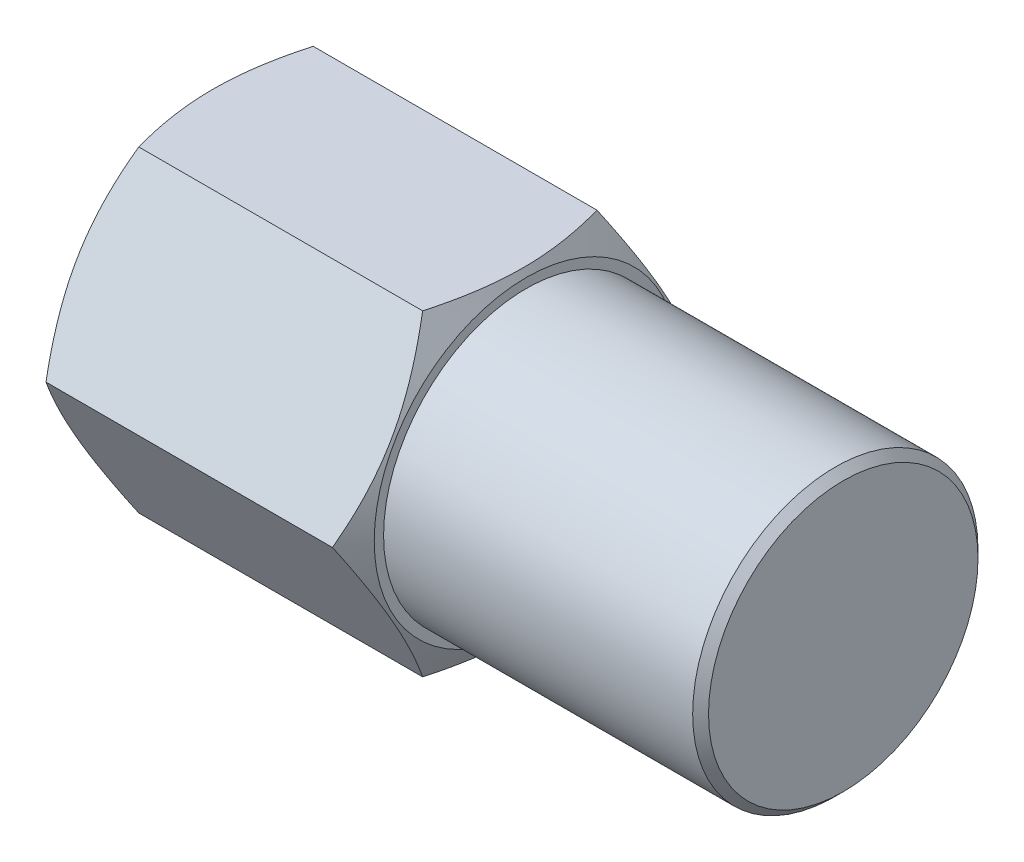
ISO-10303-21;
HEADER;
FILE_DESCRIPTION(('STEP AP214'),'2;1');
FILE_NAME('part.step','',(''),(''),'','','');
FILE_SCHEMA(('AUTOMOTIVE_DESIGN { 1 0 10303 214 1 1 1 1 }'));
ENDSEC;
DATA;
#1=APPLICATION_CONTEXT('core data for automotive mechanical design processes');
#2=APPLICATION_PROTOCOL_DEFINITION('international standard','automotive_design',2000,#1);
#3=PRODUCT_CONTEXT('',#1,'mechanical');
#4=PRODUCT('Part','Part','',(#3));
#5=PRODUCT_RELATED_PRODUCT_CATEGORY('part','',(#4));
#6=PRODUCT_DEFINITION_FORMATION('','',#4);
#7=PRODUCT_DEFINITION_CONTEXT('part definition',#1,'design');
#8=PRODUCT_DEFINITION('design','',#6,#7);
#9=PRODUCT_DEFINITION_SHAPE('','',#8);
#10=(LENGTH_UNIT() NAMED_UNIT(*) SI_UNIT(.MILLI.,.METRE.));
#11=(NAMED_UNIT(*) PLANE_ANGLE_UNIT() SI_UNIT($,.RADIAN.));
#12=(NAMED_UNIT(*) SI_UNIT($,.STERADIAN.) SOLID_ANGLE_UNIT());
#13=UNCERTAINTY_MEASURE_WITH_UNIT(LENGTH_MEASURE(1.E-05),#10,'distance_accuracy_value','');
#14=(GEOMETRIC_REPRESENTATION_CONTEXT(3) GLOBAL_UNCERTAINTY_ASSIGNED_CONTEXT((#13)) GLOBAL_UNIT_ASSIGNED_CONTEXT((#10,
#11,#12)) REPRESENTATION_CONTEXT('',''));
#15=CARTESIAN_POINT('',(0.,0.,0.));
#16=DIRECTION('',(0.,0.,1.));
#17=DIRECTION('',(1.,0.,0.));
#18=AXIS2_PLACEMENT_3D('',#15,#16,#17);
#19=CARTESIAN_POINT('',(-10.,0.,0.));
#20=DIRECTION('',(-1.,0.,0.));
#21=DIRECTION('',(0.,0.,1.));
#22=AXIS2_PLACEMENT_3D('',#19,#20,#21);
#23=CYLINDRICAL_SURFACE('',#22,3.);
#24=CARTESIAN_POINT('',(-4.,0.,0.));
#25=DIRECTION('',(-1.,0.,0.));
#26=DIRECTION('',(0.,0.,1.));
#27=AXIS2_PLACEMENT_3D('',#24,#25,#26);
#28=CIRCLE('',#27,3.);
#29=CARTESIAN_POINT('',(-4.,0.,3.));
#30=VERTEX_POINT('',#29);
#31=EDGE_CURVE('P0_E20',#30,#30,#28,.T.);
#32=ORIENTED_EDGE('',*,*,#31,.T.);
#33=EDGE_LOOP('',(#32));
#34=FACE_BOUND('',#33,.T.);
#35=CARTESIAN_POINT('',(-10.,0.,0.));
#36=DIRECTION('',(-1.,0.,0.));
#37=DIRECTION('',(0.,0.,1.));
#38=AXIS2_PLACEMENT_3D('',#35,#36,#37);
#39=CIRCLE('',#38,3.);
#40=CARTESIAN_POINT('',(-10.,0.,3.));
#41=VERTEX_POINT('',#40);
#42=EDGE_CURVE('P0_E11',#41,#41,#39,.F.);
#43=ORIENTED_EDGE('',*,*,#42,.T.);
#44=EDGE_LOOP('',(#43));
#45=FACE_BOUND('',#44,.T.);
#46=ADVANCED_FACE('P0_F16',(#34,#45),#23,.T.);
#47=CARTESIAN_POINT('',(-4.,0.,0.));
#48=DIRECTION('',(-1.,0.,0.));
#49=DIRECTION('',(0.,0.,1.));
#50=AXIS2_PLACEMENT_3D('',#47,#48,#49);
#51=PLANE('',#50);
#52=CARTESIAN_POINT('',(-4.,2.4,0.));
#53=CARTESIAN_POINT('',(-4.,2.39979755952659,0.458028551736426));
#54=CARTESIAN_POINT('',(-4.,2.23149192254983,0.883427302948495));
#55=CARTESIAN_POINT('',(-4.,2.04882177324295,1.3451328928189));
#56=CARTESIAN_POINT('',(-4.,1.69705627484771,1.69705627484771));
#57=CARTESIAN_POINT('',(-4.,1.34603579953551,2.04823429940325));
#58=CARTESIAN_POINT('',(-4.,0.883427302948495,2.23149192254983));
#59=CARTESIAN_POINT('',(-4.,0.458307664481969,2.39989871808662));
#60=CARTESIAN_POINT('',(-4.,0.,2.4));
#61=CARTESIAN_POINT('',(-4.,-0.457261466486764,2.40010105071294));
#62=CARTESIAN_POINT('',(-4.,-0.883427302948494,2.23149192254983));
#63=CARTESIAN_POINT('',(-4.,-1.34513289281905,2.0488217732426));
#64=CARTESIAN_POINT('',(-4.,-1.69705627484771,1.69705627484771));
#65=CARTESIAN_POINT('',(-4.,-2.04823429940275,1.3460357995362));
#66=CARTESIAN_POINT('',(-4.,-2.23149192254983,0.883427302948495));
#67=CARTESIAN_POINT('',(-4.,-2.39979732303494,0.458563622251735));
#68=CARTESIAN_POINT('',(-4.,-2.4,0.));
#69=B_SPLINE_CURVE_WITH_KNOTS('',2,(#52,#53,#54,#55,#56,#57,#58,#59,#60,#61,#62,#63,#64,#65,#66,
#67,#68),.UNSPECIFIED.,.F.,.F.,(3,2,2,2,2,2,2,2,3),(0.,0.125,0.25,0.375,0.5,0.625,0.75,0.875,
1.),.UNSPECIFIED.);
#70=CARTESIAN_POINT('',(-4.,2.4,0.));
#71=VERTEX_POINT('',#70);
#72=CARTESIAN_POINT('',(-4.,-2.4,0.));
#73=VERTEX_POINT('',#72);
#74=EDGE_CURVE('P0_E28',#71,#73,#69,.T.);
#75=ORIENTED_EDGE('',*,*,#74,.F.);
#76=CARTESIAN_POINT('',(-4.,-2.4,0.));
#77=CARTESIAN_POINT('',(-4.,-2.39979755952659,-0.458028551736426));
#78=CARTESIAN_POINT('',(-4.,-2.23149192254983,-0.883427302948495));
#79=CARTESIAN_POINT('',(-4.,-2.04882177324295,-1.3451328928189));
#80=CARTESIAN_POINT('',(-4.,-1.69705627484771,-1.69705627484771));
#81=CARTESIAN_POINT('',(-4.,-1.34603579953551,-2.04823429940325));
#82=CARTESIAN_POINT('',(-4.,-0.883427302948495,-2.23149192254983));
#83=CARTESIAN_POINT('',(-4.,-0.458307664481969,-2.39989871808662));
#84=CARTESIAN_POINT('',(-4.,0.,-2.4));
#85=CARTESIAN_POINT('',(-4.,0.457261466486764,-2.40010105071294));
#86=CARTESIAN_POINT('',(-4.,0.883427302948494,-2.23149192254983));
#87=CARTESIAN_POINT('',(-4.,1.34513289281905,-2.0488217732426));
#88=CARTESIAN_POINT('',(-4.,1.69705627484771,-1.69705627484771));
#89=CARTESIAN_POINT('',(-4.,2.04823429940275,-1.3460357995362));
#90=CARTESIAN_POINT('',(-4.,2.23149192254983,-0.883427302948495));
#91=CARTESIAN_POINT('',(-4.,2.39979732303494,-0.458563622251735));
#92=CARTESIAN_POINT('',(-4.,2.4,0.));
#93=B_SPLINE_CURVE_WITH_KNOTS('',2,(#76,#77,#78,#79,#80,#81,#82,#83,#84,#85,#86,#87,#88,#89,#90,
#91,#92),.UNSPECIFIED.,.F.,.F.,(3,2,2,2,2,2,2,2,3),(0.,0.125,0.25,0.375,0.5,0.625,0.75,0.875,
1.),.UNSPECIFIED.);
#94=EDGE_CURVE('P0_E33',#73,#71,#93,.T.);
#95=ORIENTED_EDGE('',*,*,#94,.F.);
#96=EDGE_LOOP('',(#75,#95));
#97=FACE_BOUND('',#96,.T.);
#98=ORIENTED_EDGE('',*,*,#31,.F.);
#99=EDGE_LOOP('',(#98));
#100=FACE_BOUND('',#99,.T.);
#101=ADVANCED_FACE('P0_F17',(#97,#100),#51,.F.);
#102=OPEN_SHELL('',(#46,#101));
#103=SHELL_BASED_SURFACE_MODEL('P0_B1',(#102));
#104=CARTESIAN_POINT('',(9.,0.,0.005403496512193));
#105=DIRECTION('',(-1.,0.,0.));
#106=DIRECTION('',(0.,0.,1.));
#107=AXIS2_PLACEMENT_3D('',#104,#105,#106);
#108=PLANE('',#107);
#109=CARTESIAN_POINT('',(9.,0.,0.005403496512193));
#110=DIRECTION('',(-1.,0.,0.));
#111=DIRECTION('',(0.,0.,1.));
#112=AXIS2_PLACEMENT_3D('',#109,#110,#111);
#113=CIRCLE('',#112,3.005403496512);
#114=CARTESIAN_POINT('',(9.,0.,3.01080699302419));
#115=VERTEX_POINT('',#114);
#116=EDGE_CURVE('P1_E19',#115,#115,#113,.T.);
#117=ORIENTED_EDGE('',*,*,#116,.T.);
#118=EDGE_LOOP('',(#117));
#119=FACE_BOUND('',#118,.T.);
#120=ADVANCED_FACE('P1_F16',(#119),#108,.T.);
#121=CARTESIAN_POINT('',(10.5,0.,0.005403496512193));
#122=DIRECTION('',(-1.,0.,0.));
#123=DIRECTION('',(0.,0.,1.));
#124=AXIS2_PLACEMENT_3D('',#121,#122,#123);
#125=CYLINDRICAL_SURFACE('',#124,3.005403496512);
#126=ORIENTED_EDGE('',*,*,#116,.F.);
#127=EDGE_LOOP('',(#126));
#128=FACE_BOUND('',#127,.T.);
#129=CARTESIAN_POINT('',(0.,0.,0.005403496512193));
#130=DIRECTION('',(-1.,0.,0.));
#131=DIRECTION('',(0.,0.,1.));
#132=AXIS2_PLACEMENT_3D('',#129,#130,#131);
#133=CIRCLE('',#132,3.005403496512);
#134=CARTESIAN_POINT('',(0.,0.,3.01080699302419));
#135=VERTEX_POINT('',#134);
#136=EDGE_CURVE('P1_E408',#135,#135,#133,.T.);
#137=ORIENTED_EDGE('',*,*,#136,.T.);
#138=EDGE_LOOP('',(#137));
#139=FACE_BOUND('',#138,.T.);
#140=ADVANCED_FACE('P1_F327',(#128,#139),#125,.F.);
#141=CARTESIAN_POINT('',(0.,27.5,-24.98464223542));
#142=DIRECTION('',(-1.,0.,0.));
#143=DIRECTION('',(0.,0.,1.));
#144=AXIS2_PLACEMENT_3D('',#141,#142,#143);
#145=PLANE('',#144);
#146=CARTESIAN_POINT('',(-5.6843418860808E-11,0.,0.));
#147=DIRECTION('',(1.,0.,0.));
#148=DIRECTION('',(0.,0.,-1.));
#149=AXIS2_PLACEMENT_3D('',#146,#147,#148);
#150=CIRCLE('',#149,2.65000000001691);
#151=CARTESIAN_POINT('',(-5.6843418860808E-11,0.,-2.65000000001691));
#152=VERTEX_POINT('',#151);
#153=EDGE_CURVE('P1_E251',#152,#152,#150,.F.);
#154=ORIENTED_EDGE('',*,*,#153,.T.);
#155=EDGE_LOOP('',(#154));
#156=FACE_BOUND('',#155,.T.);
#157=ORIENTED_EDGE('',*,*,#136,.F.);
#158=EDGE_LOOP('',(#157));
#159=FACE_BOUND('',#158,.T.);
#160=ADVANCED_FACE('P1_F318',(#156,#159),#145,.F.);
#161=CARTESIAN_POINT('',(-5.6843418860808E-11,0.,0.));
#162=DIRECTION('',(1.,0.,0.));
#163=DIRECTION('',(0.,0.,-1.));
#164=AXIS2_PLACEMENT_3D('',#161,#162,#163);
#165=CONICAL_SURFACE('',#164,2.65000000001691,0.785398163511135);
#166=CARTESIAN_POINT('',(-0.2500000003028,0.,0.));
#167=DIRECTION('',(1.,0.,0.));
#168=DIRECTION('',(0.,0.,-1.));
#169=AXIS2_PLACEMENT_3D('',#166,#167,#168);
#170=CIRCLE('',#169,2.4);
#171=CARTESIAN_POINT('',(-0.2500000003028,0.,-2.4));
#172=VERTEX_POINT('',#171);
#173=EDGE_CURVE('P1_E247',#172,#172,#170,.F.);
#174=ORIENTED_EDGE('',*,*,#173,.T.);
#175=EDGE_LOOP('',(#174));
#176=FACE_BOUND('',#175,.T.);
#177=ORIENTED_EDGE('',*,*,#153,.F.);
#178=EDGE_LOOP('',(#177));
#179=FACE_BOUND('',#178,.T.);
#180=ADVANCED_FACE('P1_F309',(#176,#179),#165,.F.);
#181=CARTESIAN_POINT('',(0.,0.,0.));
#182=DIRECTION('',(1.,0.,0.));
#183=DIRECTION('',(0.,0.,-1.));
#184=AXIS2_PLACEMENT_3D('',#181,#182,#183);
#185=CYLINDRICAL_SURFACE('',#184,2.4);
#186=ORIENTED_EDGE('',*,*,#173,.F.);
#187=EDGE_LOOP('',(#186));
#188=FACE_BOUND('',#187,.T.);
#189=CARTESIAN_POINT('',(-9.75000000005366,0.,0.));
#190=DIRECTION('',(-1.,0.,0.));
#191=DIRECTION('',(0.,0.,-1.));
#192=AXIS2_PLACEMENT_3D('',#189,#190,#191);
#193=CIRCLE('',#192,2.40000000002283);
#194=CARTESIAN_POINT('',(-9.75000000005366,0.,-2.40000000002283));
#195=VERTEX_POINT('',#194);
#196=EDGE_CURVE('P1_E250',#195,#195,#193,.T.);
#197=ORIENTED_EDGE('',*,*,#196,.T.);
#198=EDGE_LOOP('',(#197));
#199=FACE_BOUND('',#198,.T.);
#200=ADVANCED_FACE('P1_F301',(#188,#199),#185,.F.);
#201=CARTESIAN_POINT('',(-10.0000000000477,0.,0.));
#202=DIRECTION('',(-1.,0.,0.));
#203=DIRECTION('',(0.,0.,1.));
#204=AXIS2_PLACEMENT_3D('',#201,#202,#203);
#205=CONICAL_SURFACE('',#204,2.65000000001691,0.785398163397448);
#206=ORIENTED_EDGE('',*,*,#196,.F.);
#207=EDGE_LOOP('',(#206));
#208=FACE_BOUND('',#207,.T.);
#209=CARTESIAN_POINT('',(-10.0000000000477,0.,0.));
#210=DIRECTION('',(-1.,0.,0.));
#211=DIRECTION('',(0.,0.,1.));
#212=AXIS2_PLACEMENT_3D('',#209,#210,#211);
#213=CIRCLE('',#212,2.65000000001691);
#214=CARTESIAN_POINT('',(-10.0000000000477,0.,2.65000000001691));
#215=VERTEX_POINT('',#214);
#216=EDGE_CURVE('P1_E254',#215,#215,#213,.F.);
#217=ORIENTED_EDGE('',*,*,#216,.F.);
#218=EDGE_LOOP('',(#217));
#219=FACE_BOUND('',#218,.T.);
#220=ADVANCED_FACE('P1_F293',(#208,#219),#205,.F.);
#221=CARTESIAN_POINT('',(-10.,0.,0.));
#222=DIRECTION('',(-1.,0.,0.));
#223=DIRECTION('',(0.,0.,1.));
#224=AXIS2_PLACEMENT_3D('',#221,#222,#223);
#225=PLANE('',#224);
#226=ORIENTED_EDGE('',*,*,#216,.T.);
#227=EDGE_LOOP('',(#226));
#228=FACE_BOUND('',#227,.T.);
#229=CARTESIAN_POINT('',(-9.99999999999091,0.,0.));
#230=DIRECTION('',(1.,0.,0.));
#231=DIRECTION('',(0.,0.,-1.));
#232=AXIS2_PLACEMENT_3D('',#229,#230,#231);
#233=CIRCLE('',#232,4.79999999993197);
#234=CARTESIAN_POINT('',(-9.99999999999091,0.,-4.79999999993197));
#235=VERTEX_POINT('',#234);
#236=EDGE_CURVE('P1_E79',#235,#235,#233,.T.);
#237=ORIENTED_EDGE('',*,*,#236,.F.);
#238=EDGE_LOOP('',(#237));
#239=FACE_BOUND('',#238,.T.);
#240=ADVANCED_FACE('P1_F118',(#228,#239),#225,.T.);
#241=CARTESIAN_POINT('',(-9.47357534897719,0.,0.));
#242=DIRECTION('',(1.,0.,0.));
#243=DIRECTION('',(0.,0.,-1.));
#244=AXIS2_PLACEMENT_3D('',#241,#242,#243);
#245=CONICAL_SURFACE('',#244,5.7117942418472,1.04719755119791);
#246=CARTESIAN_POINT('',(-9.47671505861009,5.00000000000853,-2.74999999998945));
#247=CARTESIAN_POINT('',(-9.53960063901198,5.00000000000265,-2.5240517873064));
#248=CARTESIAN_POINT('',(-9.59698477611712,5.00000000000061,-2.29640028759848));
#249=CARTESIAN_POINT('',(-9.69816304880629,4.99999999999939,-1.83767435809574));
#250=CARTESIAN_POINT('',(-9.741931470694,5.0000000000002,-1.60659430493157));
#251=CARTESIAN_POINT('',(-9.81227350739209,4.9999999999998,-1.14682284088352));
#252=CARTESIAN_POINT('',(-9.83919529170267,4.99999999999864,-0.918186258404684));
#253=CARTESIAN_POINT('',(-9.87531537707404,5.00000000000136,-0.459698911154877));
#254=CARTESIAN_POINT('',(-9.88452994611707,5.00000000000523,-0.229849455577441));
#255=CARTESIAN_POINT('',(-9.88452994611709,5.00000000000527,0.229849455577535));
#256=CARTESIAN_POINT('',(-9.87531537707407,5.00000000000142,0.459698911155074));
#257=CARTESIAN_POINT('',(-9.8391952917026,4.99999999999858,0.918186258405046));
#258=CARTESIAN_POINT('',(-9.8122735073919,4.99999999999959,1.14682284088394));
#259=CARTESIAN_POINT('',(-9.74193147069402,5.00000000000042,1.60659430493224));
#260=CARTESIAN_POINT('',(-9.69816304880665,5.00000000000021,1.8376743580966));
#261=CARTESIAN_POINT('',(-9.5969847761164,4.99999999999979,2.2964002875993));
#262=CARTESIAN_POINT('',(-9.53960063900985,4.99999999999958,2.52405178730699));
#263=CARTESIAN_POINT('',(-9.47671505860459,5.,2.74999999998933));
#264=B_SPLINE_CURVE_WITH_KNOTS('',3,(#246,#247,#248,#249,#250,#251,#252,#253,#254,#255,#256,
#257,#258,#259,#260,#261,#262,#263),.UNSPECIFIED.,.F.,.F.,(4,2,2,2,2,2,2,2,4),(0.,
0.7037903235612,1.40890181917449,2.09891266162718,2.7882892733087,3.47766588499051,
4.16767672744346,4.87278822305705,5.57657854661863),.UNSPECIFIED.);
#265=CARTESIAN_POINT('',(-9.47671505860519,4.99999999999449,-2.74999999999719));
#266=VERTEX_POINT('',#265);
#267=CARTESIAN_POINT('',(-9.47671505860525,4.99999999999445,2.74999999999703));
#268=VERTEX_POINT('',#267);
#269=EDGE_CURVE('P1_E140',#266,#268,#264,.T.);
#270=ORIENTED_EDGE('',*,*,#269,.F.);
#271=CARTESIAN_POINT('',(-9.51690138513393,1.3916856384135E-11,-5.63675134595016));
#272=CARTESIAN_POINT('',(-9.58843945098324,0.214552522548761,-5.51287938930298));
#273=CARTESIAN_POINT('',(-9.65349865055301,0.430957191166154,-5.38793809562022));
#274=CARTESIAN_POINT('',(-9.76705512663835,0.867519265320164,-5.1358888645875));
#275=CARTESIAN_POINT('',(-9.81551181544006,1.08768450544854,-5.00877640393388));
#276=CARTESIAN_POINT('',(-9.89091637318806,1.52520606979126,-4.75617321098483));
#277=CARTESIAN_POINT('',(-9.91837384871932,1.74249407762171,-4.63072192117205));
#278=CARTESIAN_POINT('',(-9.95114618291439,2.17808466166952,-4.37923358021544));
#279=CARTESIAN_POINT('',(-9.95648860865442,2.39638563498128,-4.25319745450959));
#280=CARTESIAN_POINT('',(-9.94506621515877,2.8143082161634,-4.01190973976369));
#281=CARTESIAN_POINT('',(-9.93010777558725,3.01396944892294,-3.89663527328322));
#282=CARTESIAN_POINT('',(-9.88245642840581,3.41188355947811,-3.66689945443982));
#283=CARTESIAN_POINT('',(-9.84974441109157,3.61013468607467,-3.55243911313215));
#284=CARTESIAN_POINT('',(-9.76800008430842,4.00888962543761,-3.32221784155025));
#285=CARTESIAN_POINT('',(-9.71859846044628,4.20933503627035,-3.20649062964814));
#286=CARTESIAN_POINT('',(-9.6067254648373,4.60700987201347,-2.9768929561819));
#287=CARTESIAN_POINT('',(-9.54428420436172,4.80424559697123,-2.86301885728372));
#288=CARTESIAN_POINT('',(-9.476715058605,4.99999999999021,-2.75000000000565));
#289=B_SPLINE_CURVE_WITH_KNOTS('',3,(#271,#272,#273,#274,#275,#276,#277,#278,#279,#280,#281,
#282,#283,#284,#285,#286,#287,#288),.UNSPECIFIED.,.F.,.F.,(4,2,2,2,2,2,2,2,4),(0.,
0.773901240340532,1.54968113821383,2.30597824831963,3.06133232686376,3.75369717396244,
4.44680875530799,5.15638920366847,5.86434884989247),.UNSPECIFIED.);
#290=CARTESIAN_POINT('',(-9.51690138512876,0.,-5.63675134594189));
#291=VERTEX_POINT('',#290);
#292=EDGE_CURVE('P1_E75',#291,#266,#289,.T.);
#293=ORIENTED_EDGE('',*,*,#292,.F.);
#294=CARTESIAN_POINT('',(-9.47671505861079,-4.99999999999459,-2.75000000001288));
#295=CARTESIAN_POINT('',(-9.5514568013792,-4.78347278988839,-2.87501204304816));
#296=CARTESIAN_POINT('',(-9.6199297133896,-4.56510188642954,-3.00108854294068));
#297=CARTESIAN_POINT('',(-9.74058936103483,-4.12442896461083,-3.25551117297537));
#298=CARTESIAN_POINT('',(-9.79273201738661,-3.90211798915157,-3.38386247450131));
#299=CARTESIAN_POINT('',(-9.87547055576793,-3.46019864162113,-3.63900472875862));
#300=CARTESIAN_POINT('',(-9.9065825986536,-3.2406661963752,-3.76575184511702));
#301=CARTESIAN_POINT('',(-9.9365054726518,-2.91040959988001,-3.9564255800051));
#302=CARTESIAN_POINT('',(-9.9436895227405,-2.80022337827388,-4.02004162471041));
#303=CARTESIAN_POINT('',(-9.95233967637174,-2.5796841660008,-4.14736999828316));
#304=CARTESIAN_POINT('',(-9.9538059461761,-2.46933118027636,-4.21108232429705));
#305=CARTESIAN_POINT('',(-9.94982494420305,-2.1616773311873,-4.38870635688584));
#306=CARTESIAN_POINT('',(-9.93801614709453,-1.96441458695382,-4.50259605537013));
#307=CARTESIAN_POINT('',(-9.89681298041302,-1.57111476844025,-4.72966781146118));
#308=CARTESIAN_POINT('',(-9.86740034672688,-1.37507918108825,-4.84284901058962));
#309=CARTESIAN_POINT('',(-9.79227778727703,-0.980705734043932,-5.0705406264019));
#310=CARTESIAN_POINT('',(-9.7462022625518,-0.782421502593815,-5.18502008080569));
#311=CARTESIAN_POINT('',(-9.64079065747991,-0.388937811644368,-5.41219799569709));
#312=CARTESIAN_POINT('',(-9.58148310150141,-0.193732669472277,-5.52489973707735));
#313=CARTESIAN_POINT('',(-9.51690138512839,-9.45647906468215E-12,-5.63675134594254));
#314=B_SPLINE_CURVE_WITH_KNOTS('',3,(#294,#295,#296,#297,#298,#299,#300,#301,#302,#303,#304,
#305,#306,#307,#308,#309,#310,#311,#312,#313),.UNSPECIFIED.,.F.,.F.,(4,2,2,2,2,2,2,2,2,4),(0.,
0.783151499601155,1.56839904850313,2.33359684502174,2.71578867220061,3.09796938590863,
3.78144037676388,4.46562170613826,5.16582881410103,5.86454082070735),.UNSPECIFIED.);
#315=CARTESIAN_POINT('',(-9.47671505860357,-4.99999999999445,-2.75000000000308));
#316=VERTEX_POINT('',#315);
#317=EDGE_CURVE('P1_E67',#316,#291,#314,.T.);
#318=ORIENTED_EDGE('',*,*,#317,.F.);
#319=CARTESIAN_POINT('',(-9.47671505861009,-5.00000000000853,2.74999999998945));
#320=CARTESIAN_POINT('',(-9.53960063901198,-5.00000000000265,2.5240517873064));
#321=CARTESIAN_POINT('',(-9.59698477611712,-5.00000000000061,2.29640028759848));
#322=CARTESIAN_POINT('',(-9.69816304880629,-4.99999999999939,1.83767435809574));
#323=CARTESIAN_POINT('',(-9.741931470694,-5.0000000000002,1.60659430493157));
#324=CARTESIAN_POINT('',(-9.81227350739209,-4.9999999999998,1.14682284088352));
#325=CARTESIAN_POINT('',(-9.83919529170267,-4.99999999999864,0.918186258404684));
#326=CARTESIAN_POINT('',(-9.87531537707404,-5.00000000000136,0.459698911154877));
#327=CARTESIAN_POINT('',(-9.88452994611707,-5.00000000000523,0.229849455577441));
#328=CARTESIAN_POINT('',(-9.88452994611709,-5.00000000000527,-0.229849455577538));
#329=CARTESIAN_POINT('',(-9.87531537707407,-5.00000000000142,-0.45969891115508));
#330=CARTESIAN_POINT('',(-9.8391952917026,-4.99999999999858,-0.918186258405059));
#331=CARTESIAN_POINT('',(-9.8122735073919,-4.99999999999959,-1.14682284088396));
#332=CARTESIAN_POINT('',(-9.74193147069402,-5.00000000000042,-1.60659430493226));
#333=CARTESIAN_POINT('',(-9.69816304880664,-5.00000000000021,-1.83767435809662));
#334=CARTESIAN_POINT('',(-9.59698477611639,-4.99999999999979,-2.29640028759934));
#335=CARTESIAN_POINT('',(-9.53960063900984,-4.99999999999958,-2.52405178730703));
#336=CARTESIAN_POINT('',(-9.47671505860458,-5.,-2.74999999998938));
#337=B_SPLINE_CURVE_WITH_KNOTS('',3,(#319,#320,#321,#322,#323,#324,#325,#326,#327,#328,#329,
#330,#331,#332,#333,#334,#335,#336),.UNSPECIFIED.,.F.,.F.,(4,2,2,2,2,2,2,2,4),(0.,
0.7037903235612,1.40890181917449,2.09891266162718,2.7882892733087,3.47766588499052,
4.16767672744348,4.87278822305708,5.57657854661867),.UNSPECIFIED.);
#338=CARTESIAN_POINT('',(-9.47671505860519,-4.99999999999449,2.74999999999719));
#339=VERTEX_POINT('',#338);
#340=EDGE_CURVE('P1_E73',#339,#316,#337,.T.);
#341=ORIENTED_EDGE('',*,*,#340,.F.);
#342=CARTESIAN_POINT('',(-9.51690138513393,-1.39341041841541E-11,5.63675134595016));
#343=CARTESIAN_POINT('',(-9.58843945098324,-0.214552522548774,5.51287938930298));
#344=CARTESIAN_POINT('',(-9.65349865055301,-0.430957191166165,5.38793809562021));
#345=CARTESIAN_POINT('',(-9.76705512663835,-0.867519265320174,5.13588886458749));
#346=CARTESIAN_POINT('',(-9.81551181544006,-1.08768450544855,5.00877640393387));
#347=CARTESIAN_POINT('',(-9.89091637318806,-1.52520606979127,4.75617321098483));
#348=CARTESIAN_POINT('',(-9.91837384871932,-1.74249407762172,4.63072192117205));
#349=CARTESIAN_POINT('',(-9.95114618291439,-2.17808466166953,4.37923358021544));
#350=CARTESIAN_POINT('',(-9.95648860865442,-2.39638563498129,4.25319745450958));
#351=CARTESIAN_POINT('',(-9.94506621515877,-2.81430821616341,4.01190973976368));
#352=CARTESIAN_POINT('',(-9.93010777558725,-3.01396944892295,3.89663527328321));
#353=CARTESIAN_POINT('',(-9.88245642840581,-3.41188355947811,3.66689945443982));
#354=CARTESIAN_POINT('',(-9.84974441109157,-3.61013468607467,3.55243911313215));
#355=CARTESIAN_POINT('',(-9.76800008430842,-4.00888962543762,3.32221784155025));
#356=CARTESIAN_POINT('',(-9.71859846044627,-4.20933503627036,3.20649062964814));
#357=CARTESIAN_POINT('',(-9.6067254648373,-4.60700987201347,2.9768929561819));
#358=CARTESIAN_POINT('',(-9.54428420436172,-4.80424559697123,2.86301885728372));
#359=CARTESIAN_POINT('',(-9.476715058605,-4.99999999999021,2.75000000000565));
#360=B_SPLINE_CURVE_WITH_KNOTS('',3,(#342,#343,#344,#345,#346,#347,#348,#349,#350,#351,#352,
#353,#354,#355,#356,#357,#358,#359),.UNSPECIFIED.,.F.,.F.,(4,2,2,2,2,2,2,2,4),(0.,
0.77390124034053,1.54968113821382,2.30597824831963,3.06133232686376,3.75369717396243,
4.44680875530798,5.15638920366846,5.86434884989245),.UNSPECIFIED.);
#361=CARTESIAN_POINT('',(-9.51690138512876,-1.14445052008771E-13,5.63675134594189));
#362=VERTEX_POINT('',#361);
#363=EDGE_CURVE('P1_E91',#362,#339,#360,.T.);
#364=ORIENTED_EDGE('',*,*,#363,.F.);
#365=CARTESIAN_POINT('',(-9.47671505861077,4.99999999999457,2.75000000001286));
#366=CARTESIAN_POINT('',(-9.5514568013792,4.78347278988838,2.87501204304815));
#367=CARTESIAN_POINT('',(-9.6199297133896,4.56510188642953,3.00108854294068));
#368=CARTESIAN_POINT('',(-9.74058936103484,4.12442896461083,3.25551117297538));
#369=CARTESIAN_POINT('',(-9.79273201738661,3.90211798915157,3.38386247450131));
#370=CARTESIAN_POINT('',(-9.87547055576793,3.46019864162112,3.63900472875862));
#371=CARTESIAN_POINT('',(-9.9065825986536,3.24066619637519,3.76575184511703));
#372=CARTESIAN_POINT('',(-9.9365054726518,2.91040959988,3.95642558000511));
#373=CARTESIAN_POINT('',(-9.9436895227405,2.80022337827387,4.02004162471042));
#374=CARTESIAN_POINT('',(-9.95233967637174,2.57968416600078,4.14736999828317));
#375=CARTESIAN_POINT('',(-9.9538059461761,2.46933118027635,4.21108232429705));
#376=CARTESIAN_POINT('',(-9.94982494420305,2.16167733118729,4.38870635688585));
#377=CARTESIAN_POINT('',(-9.93801614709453,1.96441458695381,4.50259605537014));
#378=CARTESIAN_POINT('',(-9.89681298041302,1.57111476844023,4.72966781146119));
#379=CARTESIAN_POINT('',(-9.86740034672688,1.37507918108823,4.84284901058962));
#380=CARTESIAN_POINT('',(-9.79227778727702,0.980705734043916,5.07054062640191));
#381=CARTESIAN_POINT('',(-9.74620226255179,0.782421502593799,5.1850200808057));
#382=CARTESIAN_POINT('',(-9.6407906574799,0.388937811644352,5.4121979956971));
#383=CARTESIAN_POINT('',(-9.58148310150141,0.193732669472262,5.52489973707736));
#384=CARTESIAN_POINT('',(-9.51690138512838,9.44258046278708E-12,5.63675134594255));
#385=B_SPLINE_CURVE_WITH_KNOTS('',3,(#365,#366,#367,#368,#369,#370,#371,#372,#373,#374,#375,
#376,#377,#378,#379,#380,#381,#382,#383,#384),.UNSPECIFIED.,.F.,.F.,(4,2,2,2,2,2,2,2,2,4),(0.,
0.783151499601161,1.56839904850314,2.33359684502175,2.71578867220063,3.09796938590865,
3.7814403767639,4.46562170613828,5.16582881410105,5.86454082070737),.UNSPECIFIED.);
#386=EDGE_CURVE('P1_E133',#268,#362,#385,.T.);
#387=ORIENTED_EDGE('',*,*,#386,.F.);
#388=EDGE_LOOP('',(#270,#293,#318,#341,#364,#387));
#389=FACE_BOUND('',#388,.T.);
#390=ORIENTED_EDGE('',*,*,#236,.T.);
#391=EDGE_LOOP('',(#390));
#392=FACE_BOUND('',#391,.T.);
#393=ADVANCED_FACE('P1_F69',(#389,#392),#245,.T.);
#394=CARTESIAN_POINT('',(0.,0.,-5.636751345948));
#395=DIRECTION('',(0.,-0.500000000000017,-0.866025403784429));
#396=DIRECTION('',(0.,0.866025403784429,-0.500000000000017));
#397=AXIS2_PLACEMENT_3D('',#394,#395,#396);
#398=PLANE('',#397);
#399=DIRECTION('',(1.,0.,0.));
#400=VECTOR('',#399,1.);
#401=CARTESIAN_POINT('',(0.,1.11022302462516E-13,-5.63675134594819));
#402=LINE('',#401,#400);
#403=CARTESIAN_POINT('',(-0.482741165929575,-1.44321341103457E-08,-5.63675135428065));
#404=VERTEX_POINT('',#403);
#405=EDGE_CURVE('P1_E78',#404,#291,#402,.F.);
#406=ORIENTED_EDGE('',*,*,#405,.F.);
#407=CARTESIAN_POINT('',(-0.522897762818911,-5.0000000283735,-2.74999998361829));
#408=CARTESIAN_POINT('',(-0.44821580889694,-4.78348601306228,-2.87500440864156));
#409=CARTESIAN_POINT('',(-0.379798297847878,-4.56513110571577,-3.00107167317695));
#410=CARTESIAN_POINT('',(-0.259235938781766,-4.12449652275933,-3.25547216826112));
#411=CARTESIAN_POINT('',(-0.207135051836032,-3.90220792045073,-3.38381055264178));
#412=CARTESIAN_POINT('',(-0.124458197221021,-3.46032901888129,-3.63892945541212));
#413=CARTESIAN_POINT('',(-0.0933673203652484,-3.2408144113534,-3.76566627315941));
#414=CARTESIAN_POINT('',(-0.0634606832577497,-2.91058580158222,-3.95632384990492));
#415=CARTESIAN_POINT('',(-0.0562794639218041,-2.8004089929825,-4.01993446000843));
#416=CARTESIAN_POINT('',(-0.0476297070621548,-2.57988875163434,-4.14725188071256));
#417=CARTESIAN_POINT('',(-0.0461610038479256,-2.46954532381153,-4.21095868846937));
#418=CARTESIAN_POINT('',(-0.0501283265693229,-2.16188372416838,-4.38858719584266));
#419=CARTESIAN_POINT('',(-0.061923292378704,-1.96460344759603,-4.50248701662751));
#420=CARTESIAN_POINT('',(-0.103089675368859,-1.57126673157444,-4.72958007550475));
#421=CARTESIAN_POINT('',(-0.132479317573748,-1.37521177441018,-4.84277245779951));
#422=CARTESIAN_POINT('',(-0.207547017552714,-0.980802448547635,-5.07048478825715));
#423=CARTESIAN_POINT('',(-0.253590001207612,-0.782501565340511,-5.18497385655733));
#424=CARTESIAN_POINT('',(-0.358930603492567,-0.388980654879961,-5.41217326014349));
#425=CARTESIAN_POINT('',(-0.418199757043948,-0.19375496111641,-5.52488686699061));
#426=CARTESIAN_POINT('',(-0.482741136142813,-7.49938767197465E-08,-5.63675130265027));
#427=B_SPLINE_CURVE_WITH_KNOTS('',3,(#407,#408,#409,#410,#411,#412,#413,#414,#415,#416,#417,
#418,#419,#420,#421,#422,#423,#424,#425,#426),.UNSPECIFIED.,.F.,.F.,(4,2,2,2,2,2,2,2,2,4),(0.,
0.78305570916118,1.56820336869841,2.33333382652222,2.71549281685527,3.09764072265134,
3.78117113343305,4.46541079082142,5.16565567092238,5.86440778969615),.UNSPECIFIED.);
#428=CARTESIAN_POINT('',(-0.522897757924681,-5.00000001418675,-2.74999999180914));
#429=VERTEX_POINT('',#428);
#430=EDGE_CURVE('P1_E86',#429,#404,#427,.T.);
#431=ORIENTED_EDGE('',*,*,#430,.F.);
#432=DIRECTION('',(1.,0.,0.));
#433=VECTOR('',#432,1.);
#434=CARTESIAN_POINT('',(0.,-5.,-2.75));
#435=LINE('',#434,#433);
#436=EDGE_CURVE('P1_E83',#316,#429,#435,.T.);
#437=ORIENTED_EDGE('',*,*,#436,.F.);
#438=ORIENTED_EDGE('',*,*,#317,.T.);
#439=EDGE_LOOP('',(#406,#431,#437,#438));
#440=FACE_BOUND('',#439,.T.);
#441=ADVANCED_FACE('P1_F84',(#440),#398,.T.);
#442=CARTESIAN_POINT('',(0.,5.,-2.75));
#443=DIRECTION('',(0.,0.500000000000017,-0.866025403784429));
#444=DIRECTION('',(0.,0.866025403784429,0.500000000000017));
#445=AXIS2_PLACEMENT_3D('',#442,#443,#444);
#446=PLANE('',#445);
#447=DIRECTION('',(1.,0.,0.));
#448=VECTOR('',#447,1.);
#449=CARTESIAN_POINT('',(0.,5.,-2.75));
#450=LINE('',#449,#448);
#451=CARTESIAN_POINT('',(-0.522897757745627,5.,-2.75000001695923));
#452=VERTEX_POINT('',#451);
#453=EDGE_CURVE('P1_E147',#452,#266,#450,.F.);
#454=ORIENTED_EDGE('',*,*,#453,.F.);
#455=CARTESIAN_POINT('',(-0.482741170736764,-2.88643793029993E-08,-5.63675136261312));
#456=CARTESIAN_POINT('',(-0.411260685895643,0.214538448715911,-5.5128875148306));
#457=CARTESIAN_POINT('',(-0.346254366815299,0.43092620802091,-5.38795598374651));
#458=CARTESIAN_POINT('',(-0.23278958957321,0.867448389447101,-5.13592978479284));
#459=CARTESIAN_POINT('',(-0.184371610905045,1.08759061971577,-5.00883060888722));
#460=CARTESIAN_POINT('',(-0.109022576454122,1.52507063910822,-4.75625140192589));
#461=CARTESIAN_POINT('',(-0.0815831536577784,1.74234032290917,-4.63081069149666));
#462=CARTESIAN_POINT('',(-0.0488262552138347,2.17789307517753,-4.37934419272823));
#463=CARTESIAN_POINT('',(-0.0434812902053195,2.39617454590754,-4.25331932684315));
#464=CARTESIAN_POINT('',(-0.0548801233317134,2.81409566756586,-4.01203245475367));
#465=CARTESIAN_POINT('',(-0.0698224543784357,3.01377475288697,-3.89674768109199));
#466=CARTESIAN_POINT('',(-0.117432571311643,3.41172662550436,-3.66699006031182));
#467=CARTESIAN_POINT('',(-0.15011942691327,3.60999766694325,-3.55251822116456));
#468=CARTESIAN_POINT('',(-0.231804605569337,4.00878961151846,-3.3222755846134));
#469=CARTESIAN_POINT('',(-0.281171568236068,4.20925226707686,-3.20653841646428));
#470=CARTESIAN_POINT('',(-0.392969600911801,4.6069656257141,-2.97691850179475));
#471=CARTESIAN_POINT('',(-0.455370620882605,4.80422261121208,-2.86303212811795));
#472=CARTESIAN_POINT('',(-0.522897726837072,4.99999992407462,-2.75000004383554));
#473=B_SPLINE_CURVE_WITH_KNOTS('',3,(#455,#456,#457,#458,#459,#460,#461,#462,#463,#464,#465,
#466,#467,#468,#469,#470,#471,#472),.UNSPECIFIED.,.F.,.F.,(4,2,2,2,2,2,2,2,4),(0.,
0.77380590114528,1.549486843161,2.30571654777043,3.0610050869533,3.7534293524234,
4.44659923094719,5.15621685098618,5.8642161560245),.UNSPECIFIED.);
#474=EDGE_CURVE('P1_E170',#404,#452,#473,.T.);
#475=ORIENTED_EDGE('',*,*,#474,.F.);
#476=ORIENTED_EDGE('',*,*,#405,.T.);
#477=ORIENTED_EDGE('',*,*,#292,.T.);
#478=EDGE_LOOP('',(#454,#475,#476,#477));
#479=FACE_BOUND('',#478,.T.);
#480=ADVANCED_FACE('P1_F156',(#479),#446,.T.);
#481=CARTESIAN_POINT('',(0.,5.,2.75));
#482=DIRECTION('',(0.,1.,0.));
#483=DIRECTION('',(0.,0.,1.));
#484=AXIS2_PLACEMENT_3D('',#481,#482,#483);
#485=PLANE('',#484);
#486=CARTESIAN_POINT('',(-0.522897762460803,5.,-2.75000003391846));
#487=CARTESIAN_POINT('',(-0.460057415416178,5.00000000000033,-2.52404727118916));
#488=CARTESIAN_POINT('',(-0.402715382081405,5.00000000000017,-2.2963935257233));
#489=CARTESIAN_POINT('',(-0.301612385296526,4.99999999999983,-1.83766807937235));
#490=CARTESIAN_POINT('',(-0.257877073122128,4.99999999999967,-1.60659077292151));
#491=CARTESIAN_POINT('',(-0.187587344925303,5.00000000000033,-1.14682145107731));
#492=CARTESIAN_POINT('',(-0.160685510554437,5.00000000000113,-0.918184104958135));
#493=CARTESIAN_POINT('',(-0.124592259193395,4.99999999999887,-0.459696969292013));
#494=CARTESIAN_POINT('',(-0.115384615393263,4.99999999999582,-0.229848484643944));
#495=CARTESIAN_POINT('',(-0.115384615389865,4.99999999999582,0.2298484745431));
#496=CARTESIAN_POINT('',(-0.124592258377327,4.99999999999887,0.459696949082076));
#497=CARTESIAN_POINT('',(-0.160685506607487,5.00000000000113,0.918184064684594));
#498=CARTESIAN_POINT('',(-0.18758733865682,5.00000000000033,1.14682140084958));
#499=CARTESIAN_POINT('',(-0.257877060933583,4.99999999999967,1.60659070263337));
#500=CARTESIAN_POINT('',(-0.301612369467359,4.99999999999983,1.8376679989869));
#501=CARTESIAN_POINT('',(-0.402715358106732,5.00000000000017,2.2963934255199));
#502=CARTESIAN_POINT('',(-0.460057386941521,5.00000000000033,2.52404716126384));
#503=CARTESIAN_POINT('',(-0.522897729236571,5.,2.74999991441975));
#504=B_SPLINE_CURVE_WITH_KNOTS('',3,(#486,#487,#488,#489,#490,#491,#492,#493,#494,#495,#496,
#497,#498,#499,#500,#501,#502,#503),.UNSPECIFIED.,.F.,.F.,(4,2,2,2,2,2,2,2,4),(0.,
0.703766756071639,1.40885231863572,2.09885935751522,2.7882333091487,3.47760723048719,
4.16761423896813,4.87269976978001,5.57646649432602),.UNSPECIFIED.);
#505=CARTESIAN_POINT('',(-0.522897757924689,5.00000001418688,2.74999999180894));
#506=VERTEX_POINT('',#505);
#507=EDGE_CURVE('P1_E162',#452,#506,#504,.T.);
#508=ORIENTED_EDGE('',*,*,#507,.F.);
#509=ORIENTED_EDGE('',*,*,#453,.T.);
#510=ORIENTED_EDGE('',*,*,#269,.T.);
#511=DIRECTION('',(1.,0.,0.));
#512=VECTOR('',#511,1.);
#513=CARTESIAN_POINT('',(0.,4.99999999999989,2.7499999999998));
#514=LINE('',#513,#512);
#515=EDGE_CURVE('P1_E146',#506,#268,#514,.F.);
#516=ORIENTED_EDGE('',*,*,#515,.F.);
#517=EDGE_LOOP('',(#508,#509,#510,#516));
#518=FACE_BOUND('',#517,.T.);
#519=ADVANCED_FACE('P1_F152',(#518),#485,.T.);
#520=CARTESIAN_POINT('',(0.,0.,5.636751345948));
#521=DIRECTION('',(0.,0.500000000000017,0.866025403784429));
#522=DIRECTION('',(0.,-0.866025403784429,0.500000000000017));
#523=AXIS2_PLACEMENT_3D('',#520,#521,#522);
#524=PLANE('',#523);
#525=DIRECTION('',(1.,0.,0.));
#526=VECTOR('',#525,1.);
#527=CARTESIAN_POINT('',(0.,-1.11022302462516E-13,5.63675134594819));
#528=LINE('',#527,#526);
#529=CARTESIAN_POINT('',(-0.482741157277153,-1.15443530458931E-08,5.63675133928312));
#530=VERTEX_POINT('',#529);
#531=EDGE_CURVE('P1_E260',#530,#362,#528,.F.);
#532=ORIENTED_EDGE('',*,*,#531,.F.);
#533=CARTESIAN_POINT('',(-0.522897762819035,5.00000002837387,2.74999998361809));
#534=CARTESIAN_POINT('',(-0.448215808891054,4.78348601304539,2.87500440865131));
#535=CARTESIAN_POINT('',(-0.379798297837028,4.56513110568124,3.00107167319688));
#536=CARTESIAN_POINT('',(-0.259235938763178,4.12449652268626,3.25547216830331));
#537=CARTESIAN_POINT('',(-0.20713505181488,3.90220792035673,3.38381055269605));
#538=CARTESIAN_POINT('',(-0.124458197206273,3.46032901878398,3.6389294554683));
#539=CARTESIAN_POINT('',(-0.0933673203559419,3.24081441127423,3.76566627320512));
#540=CARTESIAN_POINT('',(-0.0634606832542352,2.91058580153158,3.95632384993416));
#541=CARTESIAN_POINT('',(-0.0562794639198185,2.80040899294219,4.0199344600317));
#542=CARTESIAN_POINT('',(-0.0476297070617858,2.57988875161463,4.14725188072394));
#543=CARTESIAN_POINT('',(-0.0461610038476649,2.4695453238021,4.21095868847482));
#544=CARTESIAN_POINT('',(-0.0501283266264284,2.16188371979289,4.38858719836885));
#545=CARTESIAN_POINT('',(-0.0619232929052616,1.96460343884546,4.50248702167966));
#546=CARTESIAN_POINT('',(-0.103089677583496,1.57126671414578,4.72958008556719));
#547=CARTESIAN_POINT('',(-0.132479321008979,1.3752117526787,4.84277247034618));
#548=CARTESIAN_POINT('',(-0.207547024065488,0.980802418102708,5.07048480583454));
#549=CARTESIAN_POINT('',(-0.253590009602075,0.782501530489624,5.1849738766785));
#550=CARTESIAN_POINT('',(-0.358930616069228,0.388980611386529,5.41217328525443));
#551=CARTESIAN_POINT('',(-0.41819977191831,0.193754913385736,5.52488689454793));
#552=CARTESIAN_POINT('',(-0.482741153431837,2.30883961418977E-08,5.63675133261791));
#553=B_SPLINE_CURVE_WITH_KNOTS('',3,(#533,#534,#535,#536,#537,#538,#539,#540,#541,#542,#543,
#544,#545,#546,#547,#548,#549,#550,#551,#552),.UNSPECIFIED.,.F.,.F.,(4,2,2,2,2,2,2,2,2,4),(0.,
0.783055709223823,1.5682033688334,2.33333382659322,2.71549281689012,3.09764072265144,
3.78117114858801,4.4654108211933,5.16565571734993,5.86440785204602),.UNSPECIFIED.);
#554=EDGE_CURVE('P1_E169',#506,#530,#553,.T.);
#555=ORIENTED_EDGE('',*,*,#554,.F.);
#556=ORIENTED_EDGE('',*,*,#515,.T.);
#557=ORIENTED_EDGE('',*,*,#386,.T.);
#558=EDGE_LOOP('',(#532,#555,#556,#557));
#559=FACE_BOUND('',#558,.T.);
#560=ADVANCED_FACE('P1_F155',(#559),#524,.T.);
#561=CARTESIAN_POINT('',(0.,-5.,2.75));
#562=DIRECTION('',(0.,-0.500000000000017,0.866025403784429));
#563=DIRECTION('',(0.,-0.866025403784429,-0.500000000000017));
#564=AXIS2_PLACEMENT_3D('',#561,#562,#563);
#565=PLANE('',#564);
#566=DIRECTION('',(1.,0.,0.));
#567=VECTOR('',#566,1.);
#568=CARTESIAN_POINT('',(0.,-5.,2.75));
#569=LINE('',#568,#567);
#570=CARTESIAN_POINT('',(-0.522897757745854,-5.,2.75000001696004));
#571=VERTEX_POINT('',#570);
#572=EDGE_CURVE('P1_E34',#571,#339,#569,.F.);
#573=ORIENTED_EDGE('',*,*,#572,.F.);
#574=CARTESIAN_POINT('',(-0.482741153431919,-2.30885947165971E-08,5.63675133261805));
#575=CARTESIAN_POINT('',(-0.411260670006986,-0.214538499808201,5.51288748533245));
#576=CARTESIAN_POINT('',(-0.346254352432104,-0.430926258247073,5.38795595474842));
#577=CARTESIAN_POINT('',(-0.232789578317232,-0.86744843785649,5.13592975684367));
#578=CARTESIAN_POINT('',(-0.18437160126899,-1.08759066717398,5.00883058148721));
#579=CARTESIAN_POINT('',(-0.109022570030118,-1.52507068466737,4.7562513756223));
#580=CARTESIAN_POINT('',(-0.0815831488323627,-1.74234036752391,4.63081066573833));
#581=CARTESIAN_POINT('',(-0.0488262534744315,-2.17789311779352,4.37934416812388));
#582=CARTESIAN_POINT('',(-0.0434812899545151,-2.39617458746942,4.25331930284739));
#583=CARTESIAN_POINT('',(-0.0548801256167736,-2.81409570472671,4.01203243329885));
#584=CARTESIAN_POINT('',(-0.0698224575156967,-3.01377478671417,3.89674766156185));
#585=CARTESIAN_POINT('',(-0.11743257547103,-3.41172665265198,3.66699004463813));
#586=CARTESIAN_POINT('',(-0.15011943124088,-3.60999769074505,3.55251820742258));
#587=CARTESIAN_POINT('',(-0.231804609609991,-4.00878962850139,3.3222755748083));
#588=CARTESIAN_POINT('',(-0.281171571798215,-4.2092522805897,3.20653840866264));
#589=CARTESIAN_POINT('',(-0.392969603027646,-4.60696563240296,2.97691849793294));
#590=CARTESIAN_POINT('',(-0.455370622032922,-4.80422261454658,2.86303212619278));
#591=CARTESIAN_POINT('',(-0.522897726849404,-4.99999992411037,2.7500000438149));
#592=B_SPLINE_CURVE_WITH_KNOTS('',3,(#574,#575,#576,#577,#578,#579,#580,#581,#582,#583,#584,
#585,#586,#587,#588,#589,#590,#591),.UNSPECIFIED.,.F.,.F.,(4,2,2,2,2,2,2,2,4),(0.,
0.773805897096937,1.54948683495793,2.30571653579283,3.06100507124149,3.75342932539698,
4.44659919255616,5.1562168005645,5.86421609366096),.UNSPECIFIED.);
#593=EDGE_CURVE('P1_E199',#530,#571,#592,.T.);
#594=ORIENTED_EDGE('',*,*,#593,.F.);
#595=ORIENTED_EDGE('',*,*,#531,.T.);
#596=ORIENTED_EDGE('',*,*,#363,.T.);
#597=EDGE_LOOP('',(#573,#594,#595,#596));
#598=FACE_BOUND('',#597,.T.);
#599=ADVANCED_FACE('P1_F205',(#598),#565,.T.);
#600=CARTESIAN_POINT('',(0.,-5.,-2.75));
#601=DIRECTION('',(0.,-1.,0.));
#602=DIRECTION('',(0.,0.,-1.));
#603=AXIS2_PLACEMENT_3D('',#600,#601,#602);
#604=PLANE('',#603);
#605=ORIENTED_EDGE('',*,*,#436,.T.);
#606=CARTESIAN_POINT('',(-0.522897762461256,-5.,2.75000003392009));
#607=CARTESIAN_POINT('',(-0.460057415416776,-5.,2.52404727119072));
#608=CARTESIAN_POINT('',(-0.402715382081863,-5.,2.29639352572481));
#609=CARTESIAN_POINT('',(-0.301612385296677,-5.,1.83766807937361));
#610=CARTESIAN_POINT('',(-0.257877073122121,-5.,1.60659077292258));
#611=CARTESIAN_POINT('',(-0.187587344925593,-5.,1.14682145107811));
#612=CARTESIAN_POINT('',(-0.160685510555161,-5.,0.918184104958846));
#613=CARTESIAN_POINT('',(-0.124592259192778,-5.,0.45969696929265));
#614=CARTESIAN_POINT('',(-0.115384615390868,-5.,0.229848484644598));
#615=CARTESIAN_POINT('',(-0.115384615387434,-5.,-0.229848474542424));
#616=CARTESIAN_POINT('',(-0.12459225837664,-5.,-0.459696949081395));
#617=CARTESIAN_POINT('',(-0.160685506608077,-5.,-0.918184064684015));
#618=CARTESIAN_POINT('',(-0.187587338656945,-5.,-1.14682140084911));
#619=CARTESIAN_POINT('',(-0.257877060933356,-5.,-1.6065907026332));
#620=CARTESIAN_POINT('',(-0.301612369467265,-5.,-1.83766799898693));
#621=CARTESIAN_POINT('',(-0.4027153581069,-5.,-2.29639342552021));
#622=CARTESIAN_POINT('',(-0.460057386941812,-5.,-2.52404716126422));
#623=CARTESIAN_POINT('',(-0.522897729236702,-5.,-2.74999991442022));
#624=B_SPLINE_CURVE_WITH_KNOTS('',3,(#606,#607,#608,#609,#610,#611,#612,#613,#614,#615,#616,
#617,#618,#619,#620,#621,#622,#623),.UNSPECIFIED.,.F.,.F.,(4,2,2,2,2,2,2,2,4),(0.,
0.703766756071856,1.40885231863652,2.09885935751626,2.78823330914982,3.47760723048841,
4.16761423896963,4.87269976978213,5.57646649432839),.UNSPECIFIED.);
#625=EDGE_CURVE('P1_E193',#571,#429,#624,.T.);
#626=ORIENTED_EDGE('',*,*,#625,.F.);
#627=ORIENTED_EDGE('',*,*,#572,.T.);
#628=ORIENTED_EDGE('',*,*,#340,.T.);
#629=EDGE_LOOP('',(#605,#626,#627,#628));
#630=FACE_BOUND('',#629,.T.);
#631=ADVANCED_FACE('P1_F89',(#630),#604,.T.);
#632=CARTESIAN_POINT('',(-0.526035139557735,0.,0.));
#633=DIRECTION('',(-1.,0.,0.));
#634=DIRECTION('',(0.,0.,1.));
#635=AXIS2_PLACEMENT_3D('',#632,#633,#634);
#636=CONICAL_SURFACE('',#635,5.71179424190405,1.04751800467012);
#637=CARTESIAN_POINT('',(0.,0.,0.));
#638=DIRECTION('',(-1.,0.,0.));
#639=DIRECTION('',(0.,0.,1.));
#640=AXIS2_PLACEMENT_3D('',#637,#638,#639);
#641=CIRCLE('',#640,4.79999999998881);
#642=CARTESIAN_POINT('',(0.,0.,4.79999999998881));
#643=VERTEX_POINT('',#642);
#644=EDGE_CURVE('P1_E241',#643,#643,#641,.T.);
#645=ORIENTED_EDGE('',*,*,#644,.T.);
#646=EDGE_LOOP('',(#645));
#647=FACE_BOUND('',#646,.T.);
#648=ORIENTED_EDGE('',*,*,#625,.T.);
#649=ORIENTED_EDGE('',*,*,#430,.T.);
#650=ORIENTED_EDGE('',*,*,#474,.T.);
#651=ORIENTED_EDGE('',*,*,#507,.T.);
#652=ORIENTED_EDGE('',*,*,#554,.T.);
#653=ORIENTED_EDGE('',*,*,#593,.T.);
#654=EDGE_LOOP('',(#648,#649,#650,#651,#652,#653));
#655=FACE_BOUND('',#654,.T.);
#656=ADVANCED_FACE('P1_F180',(#647,#655),#636,.T.);
#657=CARTESIAN_POINT('',(10.,0.,0.005403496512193));
#658=DIRECTION('',(-1.,0.,0.));
#659=DIRECTION('',(0.,0.,1.));
#660=AXIS2_PLACEMENT_3D('',#657,#658,#659);
#661=PLANE('',#660);
#662=CARTESIAN_POINT('',(10.0000000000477,0.,0.00540349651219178));
#663=DIRECTION('',(-1.,0.,0.));
#664=DIRECTION('',(0.,0.,1.));
#665=AXIS2_PLACEMENT_3D('',#662,#663,#664);
#666=CIRCLE('',#665,4.24999999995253);
#667=CARTESIAN_POINT('',(10.0000000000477,0.,4.25540349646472));
#668=VERTEX_POINT('',#667);
#669=EDGE_CURVE('P1_E242',#668,#668,#666,.T.);
#670=ORIENTED_EDGE('',*,*,#669,.F.);
#671=EDGE_LOOP('',(#670));
#672=FACE_BOUND('',#671,.T.);
#673=ADVANCED_FACE('P1_F184',(#672),#661,.F.);
#674=CARTESIAN_POINT('',(0.,27.5,-24.98464223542));
#675=DIRECTION('',(-1.,0.,0.));
#676=DIRECTION('',(0.,0.,1.));
#677=AXIS2_PLACEMENT_3D('',#674,#675,#676);
#678=PLANE('',#677);
#679=CARTESIAN_POINT('',(0.,0.,0.005403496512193));
#680=DIRECTION('',(-1.,0.,0.));
#681=DIRECTION('',(0.,0.,1.));
#682=AXIS2_PLACEMENT_3D('',#679,#680,#681);
#683=CIRCLE('',#682,4.5);
#684=CARTESIAN_POINT('',(0.,0.,4.50540349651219));
#685=VERTEX_POINT('',#684);
#686=EDGE_CURVE('P1_E25',#685,#685,#683,.F.);
#687=ORIENTED_EDGE('',*,*,#686,.F.);
#688=EDGE_LOOP('',(#687));
#689=FACE_BOUND('',#688,.T.);
#690=ORIENTED_EDGE('',*,*,#644,.F.);
#691=EDGE_LOOP('',(#690));
#692=FACE_BOUND('',#691,.T.);
#693=ADVANCED_FACE('P1_F225',(#689,#692),#678,.F.);
#694=CARTESIAN_POINT('',(9.7500000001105,0.,0.00540349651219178));
#695=DIRECTION('',(-1.,0.,0.));
#696=DIRECTION('',(0.,0.,1.));
#697=AXIS2_PLACEMENT_3D('',#694,#695,#696);
#698=CONICAL_SURFACE('',#697,4.49999999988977,0.785398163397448);
#699=ORIENTED_EDGE('',*,*,#669,.T.);
#700=EDGE_LOOP('',(#699));
#701=FACE_BOUND('',#700,.T.);
#702=CARTESIAN_POINT('',(9.75,0.,0.005403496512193));
#703=DIRECTION('',(-1.,0.,0.));
#704=DIRECTION('',(0.,0.,1.));
#705=AXIS2_PLACEMENT_3D('',#702,#703,#704);
#706=CIRCLE('',#705,4.5);
#707=CARTESIAN_POINT('',(9.75,0.,4.50540349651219));
#708=VERTEX_POINT('',#707);
#709=EDGE_CURVE('P1_E11',#708,#708,#706,.T.);
#710=ORIENTED_EDGE('',*,*,#709,.F.);
#711=EDGE_LOOP('',(#710));
#712=FACE_BOUND('',#711,.T.);
#713=ADVANCED_FACE('P1_F218',(#701,#712),#698,.T.);
#714=CARTESIAN_POINT('',(10.5,0.,0.005403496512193));
#715=DIRECTION('',(-1.,0.,0.));
#716=DIRECTION('',(0.,0.,1.));
#717=AXIS2_PLACEMENT_3D('',#714,#715,#716);
#718=CYLINDRICAL_SURFACE('',#717,4.5);
#719=ORIENTED_EDGE('',*,*,#686,.T.);
#720=EDGE_LOOP('',(#719));
#721=FACE_BOUND('',#720,.T.);
#722=ORIENTED_EDGE('',*,*,#709,.T.);
#723=EDGE_LOOP('',(#722));
#724=FACE_BOUND('',#723,.T.);
#725=ADVANCED_FACE('P1_F216',(#721,#724),#718,.T.);
#726=CLOSED_SHELL('',(#120,#140,#160,#180,#200,#220,#240,#393,#441,#480,#519,#560,#599,#631,
#656,#673,#693,#713,#725));
#727=MANIFOLD_SOLID_BREP('P1_B1',#726);
#728=ADVANCED_BREP_SHAPE_REPRESENTATION('',(#18,#727),#14);
#729=MANIFOLD_SURFACE_SHAPE_REPRESENTATION('',(#18,#103),#14);
#730=SHAPE_REPRESENTATION('',(#18),#14);
#731=SHAPE_DEFINITION_REPRESENTATION(#9,#730);
#732=SHAPE_REPRESENTATION_RELATIONSHIP('','',#730,#728);
#733=SHAPE_REPRESENTATION_RELATIONSHIP('','',#730,#729);
ENDSEC;
END-ISO-10303-21;
